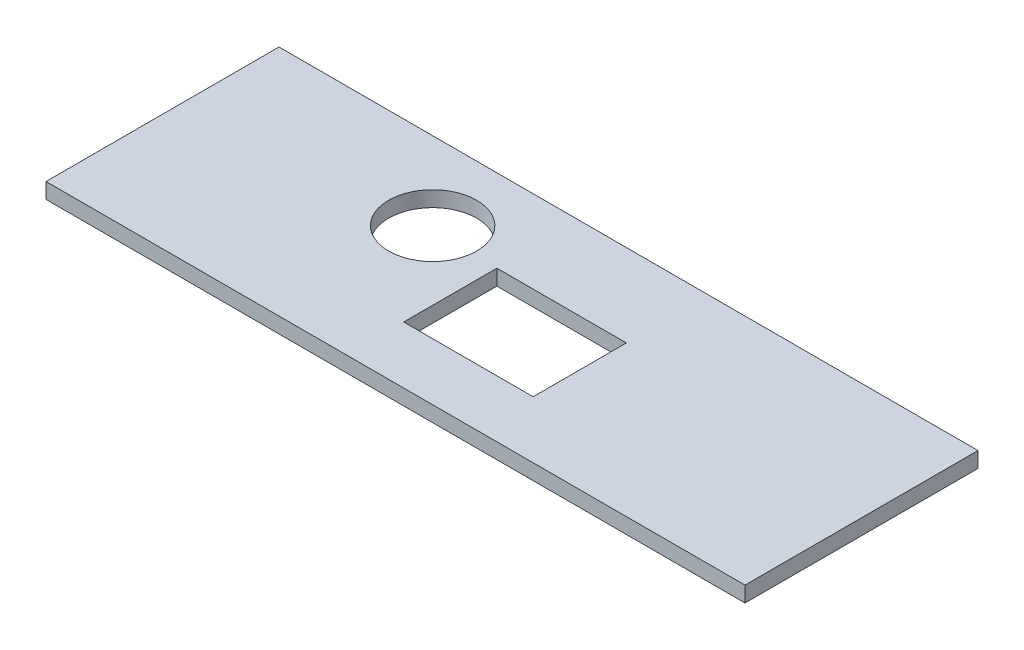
from build123d import *

# Parameters (mm, degrees)
SKETCH1_W           = 135
SKETCH1_H           = 45
BOSS_EXTRUDE1_DEPTH = 3
CUT_EXTRUDE1_REACH  = 73.214
SKETCH2_W           = 25
SKETCH2_H           = 18
CUT_EXTRUDE2_REACH  = 73.214
SKETCH3_R           = 8.5


with BuildPart() as part:
    # Sketch1 → Boss-Extrude1 (new body)
    with BuildSketch(Plane(origin=(0, 0, 0), x_dir=(1, 0, 0), z_dir=(0, 1, 0))):
        Rectangle(SKETCH1_W, SKETCH1_H)
    extrude(amount=BOSS_EXTRUDE1_DEPTH)

    # Sketch2 → Cut-Extrude1 (cut, up to next)
    with BuildSketch(Plane.XZ, mode=Mode.PRIVATE) as cut_extrude1_sk1:
        with Locations((3.04163056, 2.45836944)):
            Rectangle(SKETCH2_W, SKETCH2_H)
    cut_extrude1_tool1 = extrude(cut_extrude1_sk1.sketch, amount=-CUT_EXTRUDE1_REACH, mode=Mode.PRIVATE) & part.part
    add(cut_extrude1_tool1.solids().sort_by_distance((3.041631, 0, 2.458369))[0], mode=Mode.SUBTRACT)

    # Sketch3 → Cut-Extrude2 (cut, up to next)
    with BuildSketch(Plane(origin=(0, 0, 0), x_dir=(-1, 0, 0), z_dir=(0, -1, 0)), mode=Mode.PRIVATE) as cut_extrude2_sk1:
        with Locations(Location((22.779422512, 7.453404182, 0), (0, 0, 90))):
            Circle(SKETCH3_R)
    cut_extrude2_tool1 = extrude(cut_extrude2_sk1.sketch, amount=-CUT_EXTRUDE2_REACH, mode=Mode.PRIVATE) & part.part
    add(cut_extrude2_tool1.solids().sort_by_distance((-22.779423, 0, -7.453404))[0], mode=Mode.SUBTRACT)


solid = part.part
